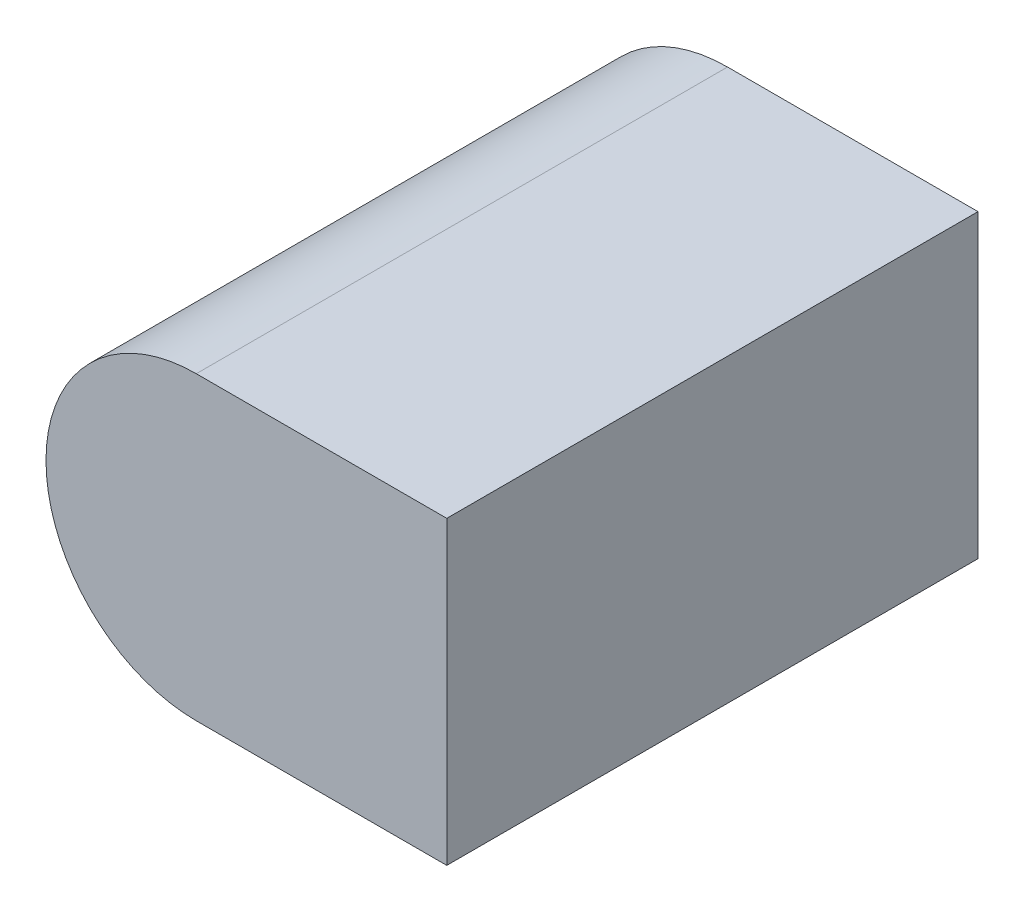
ISO-10303-21;
HEADER;
FILE_DESCRIPTION(('STEP AP214'),'2;1');
FILE_NAME('part.step','',(''),(''),'','','');
FILE_SCHEMA(('AUTOMOTIVE_DESIGN { 1 0 10303 214 1 1 1 1 }'));
ENDSEC;
DATA;
#1=APPLICATION_CONTEXT('core data for automotive mechanical design processes');
#2=APPLICATION_PROTOCOL_DEFINITION('international standard','automotive_design',2000,#1);
#3=PRODUCT_CONTEXT('',#1,'mechanical');
#4=PRODUCT('Part','Part','',(#3));
#5=PRODUCT_RELATED_PRODUCT_CATEGORY('part','',(#4));
#6=PRODUCT_DEFINITION_FORMATION('','',#4);
#7=PRODUCT_DEFINITION_CONTEXT('part definition',#1,'design');
#8=PRODUCT_DEFINITION('design','',#6,#7);
#9=PRODUCT_DEFINITION_SHAPE('','',#8);
#10=(LENGTH_UNIT() NAMED_UNIT(*) SI_UNIT(.MILLI.,.METRE.));
#11=(NAMED_UNIT(*) PLANE_ANGLE_UNIT() SI_UNIT($,.RADIAN.));
#12=(NAMED_UNIT(*) SI_UNIT($,.STERADIAN.) SOLID_ANGLE_UNIT());
#13=UNCERTAINTY_MEASURE_WITH_UNIT(LENGTH_MEASURE(1.E-05),#10,'distance_accuracy_value','');
#14=(GEOMETRIC_REPRESENTATION_CONTEXT(3) GLOBAL_UNCERTAINTY_ASSIGNED_CONTEXT((#13)) GLOBAL_UNIT_ASSIGNED_CONTEXT((#10,
#11,#12)) REPRESENTATION_CONTEXT('',''));
#15=CARTESIAN_POINT('',(0.,0.,0.));
#16=DIRECTION('',(0.,0.,1.));
#17=DIRECTION('',(1.,0.,0.));
#18=AXIS2_PLACEMENT_3D('',#15,#16,#17);
#19=CARTESIAN_POINT('',(0.,52.6131353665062,0.));
#20=DIRECTION('',(-1.,0.,0.));
#21=DIRECTION('',(0.,0.,1.));
#22=AXIS2_PLACEMENT_3D('',#19,#20,#21);
#23=PLANE('',#22);
#24=DIRECTION('',(0.,-1.,0.));
#25=VECTOR('',#24,1.);
#26=CARTESIAN_POINT('',(0.,34.2169341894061,65.024));
#27=LINE('',#26,#25);
#28=CARTESIAN_POINT('',(0.,52.6131353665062,65.024));
#29=VERTEX_POINT('',#28);
#30=CARTESIAN_POINT('',(0.,15.820733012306,65.024));
#31=VERTEX_POINT('',#30);
#32=EDGE_CURVE('E73',#29,#31,#27,.T.);
#33=ORIENTED_EDGE('',*,*,#32,.T.);
#34=DIRECTION('',(0.,0.,-1.));
#35=VECTOR('',#34,1.);
#36=CARTESIAN_POINT('',(0.,15.820733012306,65.024));
#37=LINE('',#36,#35);
#38=CARTESIAN_POINT('',(0.,15.820733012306,0.));
#39=VERTEX_POINT('',#38);
#40=EDGE_CURVE('E30',#31,#39,#37,.T.);
#41=ORIENTED_EDGE('',*,*,#40,.T.);
#42=DIRECTION('',(0.,-1.,0.));
#43=VECTOR('',#42,1.);
#44=CARTESIAN_POINT('',(0.,34.2169341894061,0.));
#45=LINE('',#44,#43);
#46=CARTESIAN_POINT('',(0.,52.6131353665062,0.));
#47=VERTEX_POINT('',#46);
#48=EDGE_CURVE('E66',#47,#39,#45,.T.);
#49=ORIENTED_EDGE('',*,*,#48,.F.);
#50=DIRECTION('',(0.,0.,-1.));
#51=VECTOR('',#50,1.);
#52=CARTESIAN_POINT('',(0.,52.6131353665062,65.024));
#53=LINE('',#52,#51);
#54=EDGE_CURVE('E42',#29,#47,#53,.T.);
#55=ORIENTED_EDGE('',*,*,#54,.F.);
#56=EDGE_LOOP('',(#33,#41,#49,#55));
#57=FACE_BOUND('',#56,.T.);
#58=ADVANCED_FACE('F26',(#57),#23,.F.);
#59=CARTESIAN_POINT('',(-30.6603352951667,34.2169341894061,65.024));
#60=DIRECTION('',(0.,0.,-1.));
#61=DIRECTION('',(-1.,0.,0.));
#62=AXIS2_PLACEMENT_3D('',#59,#60,#61);
#63=CYLINDRICAL_SURFACE('',#62,18.3962011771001);
#64=CARTESIAN_POINT('',(-30.6603352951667,34.2169341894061,0.));
#65=DIRECTION('',(0.,0.,1.));
#66=DIRECTION('',(1.,0.,0.));
#67=AXIS2_PLACEMENT_3D('',#64,#65,#66);
#68=CIRCLE('',#67,18.3962011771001);
#69=CARTESIAN_POINT('',(-30.6603352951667,52.6131353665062,0.));
#70=VERTEX_POINT('',#69);
#71=CARTESIAN_POINT('',(-30.6603352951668,15.8207330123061,0.));
#72=VERTEX_POINT('',#71);
#73=EDGE_CURVE('E35',#70,#72,#68,.T.);
#74=ORIENTED_EDGE('',*,*,#73,.T.);
#75=DIRECTION('',(0.,0.,-1.));
#76=VECTOR('',#75,1.);
#77=CARTESIAN_POINT('',(-30.6603352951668,15.8207330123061,65.024));
#78=LINE('',#77,#76);
#79=CARTESIAN_POINT('',(-30.6603352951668,15.8207330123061,65.024));
#80=VERTEX_POINT('',#79);
#81=EDGE_CURVE('E83',#80,#72,#78,.T.);
#82=ORIENTED_EDGE('',*,*,#81,.F.);
#83=CARTESIAN_POINT('',(-30.6603352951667,34.2169341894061,65.024));
#84=DIRECTION('',(0.,0.,1.));
#85=DIRECTION('',(1.,0.,0.));
#86=AXIS2_PLACEMENT_3D('',#83,#84,#85);
#87=CIRCLE('',#86,18.3962011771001);
#88=CARTESIAN_POINT('',(-30.6603352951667,52.6131353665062,65.024));
#89=VERTEX_POINT('',#88);
#90=EDGE_CURVE('E87',#89,#80,#87,.T.);
#91=ORIENTED_EDGE('',*,*,#90,.F.);
#92=DIRECTION('',(0.,0.,-1.));
#93=VECTOR('',#92,1.);
#94=CARTESIAN_POINT('',(-30.6603352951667,52.6131353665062,65.024));
#95=LINE('',#94,#93);
#96=EDGE_CURVE('E91',#89,#70,#95,.T.);
#97=ORIENTED_EDGE('',*,*,#96,.T.);
#98=EDGE_LOOP('',(#74,#82,#91,#97));
#99=FACE_BOUND('',#98,.T.);
#100=ADVANCED_FACE('F99',(#99),#63,.T.);
#101=CARTESIAN_POINT('',(-30.6603352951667,15.820733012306,65.024));
#102=DIRECTION('',(0.,1.,0.));
#103=DIRECTION('',(0.,0.,1.));
#104=AXIS2_PLACEMENT_3D('',#101,#102,#103);
#105=PLANE('',#104);
#106=DIRECTION('',(1.,0.,0.));
#107=VECTOR('',#106,1.);
#108=CARTESIAN_POINT('',(-30.6603352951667,15.820733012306,0.));
#109=LINE('',#108,#107);
#110=EDGE_CURVE('E71',#72,#39,#109,.T.);
#111=ORIENTED_EDGE('',*,*,#110,.T.);
#112=ORIENTED_EDGE('',*,*,#40,.F.);
#113=DIRECTION('',(1.,0.,0.));
#114=VECTOR('',#113,1.);
#115=CARTESIAN_POINT('',(-30.6603352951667,15.820733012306,65.024));
#116=LINE('',#115,#114);
#117=EDGE_CURVE('E95',#80,#31,#116,.T.);
#118=ORIENTED_EDGE('',*,*,#117,.F.);
#119=ORIENTED_EDGE('',*,*,#81,.T.);
#120=EDGE_LOOP('',(#111,#112,#118,#119));
#121=FACE_BOUND('',#120,.T.);
#122=ADVANCED_FACE('F81',(#121),#105,.F.);
#123=CARTESIAN_POINT('',(0.,52.6131353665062,65.024));
#124=DIRECTION('',(0.,-1.,0.));
#125=DIRECTION('',(0.,0.,-1.));
#126=AXIS2_PLACEMENT_3D('',#123,#124,#125);
#127=PLANE('',#126);
#128=DIRECTION('',(-1.,0.,0.));
#129=VECTOR('',#128,1.);
#130=CARTESIAN_POINT('',(0.,52.6131353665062,0.));
#131=LINE('',#130,#129);
#132=EDGE_CURVE('E11',#47,#70,#131,.T.);
#133=ORIENTED_EDGE('',*,*,#132,.T.);
#134=ORIENTED_EDGE('',*,*,#96,.F.);
#135=DIRECTION('',(-1.,0.,0.));
#136=VECTOR('',#135,1.);
#137=CARTESIAN_POINT('',(0.,52.6131353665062,65.024));
#138=LINE('',#137,#136);
#139=EDGE_CURVE('E84',#29,#89,#138,.T.);
#140=ORIENTED_EDGE('',*,*,#139,.F.);
#141=ORIENTED_EDGE('',*,*,#54,.T.);
#142=EDGE_LOOP('',(#133,#134,#140,#141));
#143=FACE_BOUND('',#142,.T.);
#144=ADVANCED_FACE('F106',(#143),#127,.F.);
#145=CARTESIAN_POINT('',(-30.6603352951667,34.2169341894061,0.));
#146=DIRECTION('',(0.,0.,1.));
#147=DIRECTION('',(1.,0.,0.));
#148=AXIS2_PLACEMENT_3D('',#145,#146,#147);
#149=PLANE('',#148);
#150=ORIENTED_EDGE('',*,*,#132,.F.);
#151=ORIENTED_EDGE('',*,*,#48,.T.);
#152=ORIENTED_EDGE('',*,*,#110,.F.);
#153=ORIENTED_EDGE('',*,*,#73,.F.);
#154=EDGE_LOOP('',(#150,#151,#152,#153));
#155=FACE_BOUND('',#154,.T.);
#156=ADVANCED_FACE('F68',(#155),#149,.F.);
#157=CARTESIAN_POINT('',(-30.6603352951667,34.2169341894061,65.024));
#158=DIRECTION('',(0.,0.,1.));
#159=DIRECTION('',(1.,0.,0.));
#160=AXIS2_PLACEMENT_3D('',#157,#158,#159);
#161=PLANE('',#160);
#162=ORIENTED_EDGE('',*,*,#32,.F.);
#163=ORIENTED_EDGE('',*,*,#139,.T.);
#164=ORIENTED_EDGE('',*,*,#90,.T.);
#165=ORIENTED_EDGE('',*,*,#117,.T.);
#166=EDGE_LOOP('',(#162,#163,#164,#165));
#167=FACE_BOUND('',#166,.T.);
#168=ADVANCED_FACE('F28',(#167),#161,.T.);
#169=CLOSED_SHELL('',(#58,#100,#122,#144,#156,#168));
#170=MANIFOLD_SOLID_BREP('B2',#169);
#171=ADVANCED_BREP_SHAPE_REPRESENTATION('',(#18,#170),#14);
#172=SHAPE_DEFINITION_REPRESENTATION(#9,#171);
ENDSEC;
END-ISO-10303-21;
